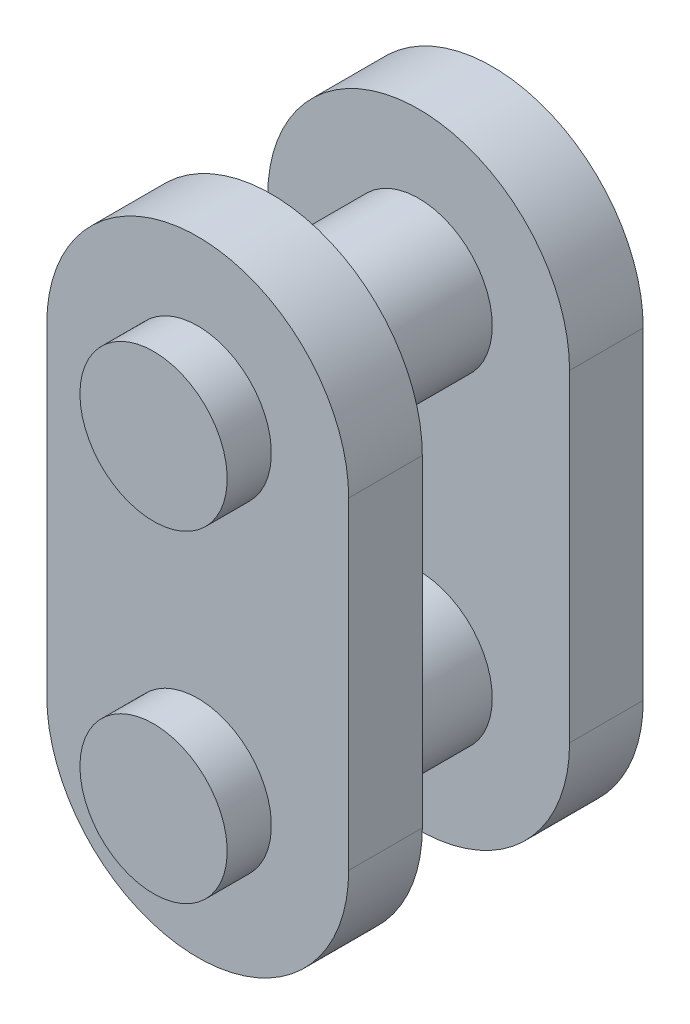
ISO-10303-21;
HEADER;
FILE_DESCRIPTION(('STEP AP214'),'2;1');
FILE_NAME('part.step','',(''),(''),'','','');
FILE_SCHEMA(('AUTOMOTIVE_DESIGN { 1 0 10303 214 1 1 1 1 }'));
ENDSEC;
DATA;
#1=APPLICATION_CONTEXT('core data for automotive mechanical design processes');
#2=APPLICATION_PROTOCOL_DEFINITION('international standard','automotive_design',2000,#1);
#3=PRODUCT_CONTEXT('',#1,'mechanical');
#4=PRODUCT('Part','Part','',(#3));
#5=PRODUCT_RELATED_PRODUCT_CATEGORY('part','',(#4));
#6=PRODUCT_DEFINITION_FORMATION('','',#4);
#7=PRODUCT_DEFINITION_CONTEXT('part definition',#1,'design');
#8=PRODUCT_DEFINITION('design','',#6,#7);
#9=PRODUCT_DEFINITION_SHAPE('','',#8);
#10=(LENGTH_UNIT() NAMED_UNIT(*) SI_UNIT(.MILLI.,.METRE.));
#11=(NAMED_UNIT(*) PLANE_ANGLE_UNIT() SI_UNIT($,.RADIAN.));
#12=(NAMED_UNIT(*) SI_UNIT($,.STERADIAN.) SOLID_ANGLE_UNIT());
#13=UNCERTAINTY_MEASURE_WITH_UNIT(LENGTH_MEASURE(1.E-05),#10,'distance_accuracy_value','');
#14=(GEOMETRIC_REPRESENTATION_CONTEXT(3) GLOBAL_UNCERTAINTY_ASSIGNED_CONTEXT((#13)) GLOBAL_UNIT_ASSIGNED_CONTEXT((#10,
#11,#12)) REPRESENTATION_CONTEXT('',''));
#15=CARTESIAN_POINT('',(0.,0.,0.));
#16=DIRECTION('',(0.,0.,1.));
#17=DIRECTION('',(1.,0.,0.));
#18=AXIS2_PLACEMENT_3D('',#15,#16,#17);
#19=CARTESIAN_POINT('',(0.,5.47500000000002,-5.));
#20=DIRECTION('',(0.,0.,-1.));
#21=DIRECTION('',(-1.00000000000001,0.,0.));
#22=AXIS2_PLACEMENT_3D('',#19,#20,#21);
#23=PLANE('',#22);
#24=CARTESIAN_POINT('',(1.31838984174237E-13,-5.47500000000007,-5.));
#25=DIRECTION('',(0.,0.,-1.));
#26=DIRECTION('',(-1.00000000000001,0.,0.));
#27=AXIS2_PLACEMENT_3D('',#24,#25,#26);
#28=CIRCLE('',#27,2.5);
#29=CARTESIAN_POINT('',(-2.49999999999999,-5.47499999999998,-4.99999999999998));
#30=VERTEX_POINT('',#29);
#31=EDGE_CURVE('E168',#30,#30,#28,.F.);
#32=ORIENTED_EDGE('',*,*,#31,.T.);
#33=EDGE_LOOP('',(#32));
#34=FACE_BOUND('',#33,.T.);
#35=CARTESIAN_POINT('',(0.,5.47500000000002,-5.));
#36=DIRECTION('',(0.,0.,1.));
#37=DIRECTION('',(-1.00000000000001,0.,0.));
#38=AXIS2_PLACEMENT_3D('',#35,#36,#37);
#39=CIRCLE('',#38,5.125);
#40=CARTESIAN_POINT('',(5.1250000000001,5.47500000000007,-5.));
#41=VERTEX_POINT('',#40);
#42=CARTESIAN_POINT('',(-5.125,5.47500000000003,-5.));
#43=VERTEX_POINT('',#42);
#44=EDGE_CURVE('E144',#41,#43,#39,.T.);
#45=ORIENTED_EDGE('',*,*,#44,.F.);
#46=DIRECTION('',(0.,1.00000000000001,0.));
#47=VECTOR('',#46,1.);
#48=CARTESIAN_POINT('',(5.1250000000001,5.47500000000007,-5.));
#49=LINE('',#48,#47);
#50=CARTESIAN_POINT('',(5.12500000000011,-5.47500000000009,-5.));
#51=VERTEX_POINT('',#50);
#52=EDGE_CURVE('E135',#51,#41,#49,.T.);
#53=ORIENTED_EDGE('',*,*,#52,.F.);
#54=CARTESIAN_POINT('',(1.31838984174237E-13,-5.47500000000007,-5.));
#55=DIRECTION('',(0.,0.,1.));
#56=DIRECTION('',(1.00000000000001,0.,0.));
#57=AXIS2_PLACEMENT_3D('',#54,#55,#56);
#58=CIRCLE('',#57,5.125);
#59=CARTESIAN_POINT('',(-5.12500000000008,-5.47499999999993,-5.));
#60=VERTEX_POINT('',#59);
#61=EDGE_CURVE('E138',#60,#51,#58,.T.);
#62=ORIENTED_EDGE('',*,*,#61,.F.);
#63=DIRECTION('',(0.,-1.00000000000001,0.));
#64=VECTOR('',#63,1.);
#65=CARTESIAN_POINT('',(-5.125,5.47500000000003,-5.));
#66=LINE('',#65,#64);
#67=EDGE_CURVE('E141',#43,#60,#66,.T.);
#68=ORIENTED_EDGE('',*,*,#67,.F.);
#69=EDGE_LOOP('',(#45,#53,#62,#68));
#70=FACE_BOUND('',#69,.T.);
#71=CARTESIAN_POINT('',(0.,5.47500000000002,-5.));
#72=DIRECTION('',(0.,0.,-1.));
#73=DIRECTION('',(-1.00000000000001,0.,0.));
#74=AXIS2_PLACEMENT_3D('',#71,#72,#73);
#75=CIRCLE('',#74,2.5);
#76=CARTESIAN_POINT('',(-2.50000000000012,5.4750000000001,-4.99999999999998));
#77=VERTEX_POINT('',#76);
#78=EDGE_CURVE('E177',#77,#77,#75,.F.);
#79=ORIENTED_EDGE('',*,*,#78,.T.);
#80=EDGE_LOOP('',(#79));
#81=FACE_BOUND('',#80,.T.);
#82=ADVANCED_FACE('F31',(#34,#70,#81),#23,.T.);
#83=CARTESIAN_POINT('',(1.45716771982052E-13,5.47500000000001,5.));
#84=DIRECTION('',(0.,0.,-1.));
#85=DIRECTION('',(-1.00000000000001,0.,0.));
#86=AXIS2_PLACEMENT_3D('',#83,#84,#85);
#87=PLANE('',#86);
#88=CARTESIAN_POINT('',(0.,-5.47500000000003,5.));
#89=DIRECTION('',(0.,0.,-1.));
#90=DIRECTION('',(-1.00000000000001,0.,0.));
#91=AXIS2_PLACEMENT_3D('',#88,#89,#90);
#92=CIRCLE('',#91,2.5);
#93=CARTESIAN_POINT('',(-2.49999999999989,-5.47500000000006,5.00000000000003));
#94=VERTEX_POINT('',#93);
#95=EDGE_CURVE('E35',#94,#94,#92,.F.);
#96=ORIENTED_EDGE('',*,*,#95,.F.);
#97=EDGE_LOOP('',(#96));
#98=FACE_BOUND('',#97,.T.);
#99=CARTESIAN_POINT('',(1.45716771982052E-13,5.47500000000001,5.));
#100=DIRECTION('',(0.,0.,1.));
#101=DIRECTION('',(-1.00000000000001,0.,0.));
#102=AXIS2_PLACEMENT_3D('',#99,#100,#101);
#103=CIRCLE('',#102,5.125);
#104=CARTESIAN_POINT('',(5.12500000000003,5.475,5.));
#105=VERTEX_POINT('',#104);
#106=CARTESIAN_POINT('',(-5.125,5.475,5.));
#107=VERTEX_POINT('',#106);
#108=EDGE_CURVE('E133',#105,#107,#103,.T.);
#109=ORIENTED_EDGE('',*,*,#108,.T.);
#110=DIRECTION('',(0.,-1.00000000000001,0.));
#111=VECTOR('',#110,1.);
#112=CARTESIAN_POINT('',(-5.125,5.475,5.));
#113=LINE('',#112,#111);
#114=CARTESIAN_POINT('',(-5.125,-5.47499999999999,5.));
#115=VERTEX_POINT('',#114);
#116=EDGE_CURVE('E114',#107,#115,#113,.T.);
#117=ORIENTED_EDGE('',*,*,#116,.T.);
#118=CARTESIAN_POINT('',(0.,-5.47500000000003,5.));
#119=DIRECTION('',(0.,0.,1.));
#120=DIRECTION('',(1.00000000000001,0.,0.));
#121=AXIS2_PLACEMENT_3D('',#118,#119,#120);
#122=CIRCLE('',#121,5.125);
#123=CARTESIAN_POINT('',(5.12500000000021,-5.47500000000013,5.));
#124=VERTEX_POINT('',#123);
#125=EDGE_CURVE('E130',#115,#124,#122,.T.);
#126=ORIENTED_EDGE('',*,*,#125,.T.);
#127=DIRECTION('',(0.,1.00000000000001,0.));
#128=VECTOR('',#127,1.);
#129=CARTESIAN_POINT('',(5.12500000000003,5.475,5.));
#130=LINE('',#129,#128);
#131=EDGE_CURVE('E128',#124,#105,#130,.T.);
#132=ORIENTED_EDGE('',*,*,#131,.T.);
#133=EDGE_LOOP('',(#109,#117,#126,#132));
#134=FACE_BOUND('',#133,.T.);
#135=CARTESIAN_POINT('',(1.45716771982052E-13,5.47500000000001,5.));
#136=DIRECTION('',(0.,0.,-1.));
#137=DIRECTION('',(-1.00000000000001,0.,0.));
#138=AXIS2_PLACEMENT_3D('',#135,#136,#137);
#139=CIRCLE('',#138,2.5);
#140=CARTESIAN_POINT('',(-2.50000000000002,5.47500000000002,5.00000000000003));
#141=VERTEX_POINT('',#140);
#142=EDGE_CURVE('E11',#141,#141,#139,.F.);
#143=ORIENTED_EDGE('',*,*,#142,.F.);
#144=EDGE_LOOP('',(#143));
#145=FACE_BOUND('',#144,.T.);
#146=ADVANCED_FACE('F200',(#98,#134,#145),#87,.F.);
#147=CARTESIAN_POINT('',(1.45716771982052E-13,5.47500000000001,5.));
#148=DIRECTION('',(0.,0.,-1.));
#149=DIRECTION('',(-1.00000000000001,0.,0.));
#150=AXIS2_PLACEMENT_3D('',#147,#148,#149);
#151=CYLINDRICAL_SURFACE('',#150,5.125);
#152=CARTESIAN_POINT('',(0.,5.47500000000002,-2.5));
#153=DIRECTION('',(0.,0.,1.));
#154=DIRECTION('',(1.00000000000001,0.,0.));
#155=AXIS2_PLACEMENT_3D('',#152,#153,#154);
#156=CIRCLE('',#155,5.125);
#157=CARTESIAN_POINT('',(5.1250000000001,5.47500000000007,-2.5));
#158=VERTEX_POINT('',#157);
#159=CARTESIAN_POINT('',(-5.125,5.47500000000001,-2.5));
#160=VERTEX_POINT('',#159);
#161=EDGE_CURVE('E152',#158,#160,#156,.T.);
#162=ORIENTED_EDGE('',*,*,#161,.F.);
#163=DIRECTION('',(0.,0.,-1.));
#164=VECTOR('',#163,1.);
#165=CARTESIAN_POINT('',(5.12500000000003,5.475,5.));
#166=LINE('',#165,#164);
#167=EDGE_CURVE('E127',#158,#41,#166,.T.);
#168=ORIENTED_EDGE('',*,*,#167,.T.);
#169=ORIENTED_EDGE('',*,*,#44,.T.);
#170=DIRECTION('',(0.,0.,-1.));
#171=VECTOR('',#170,1.);
#172=CARTESIAN_POINT('',(-5.125,5.475,5.));
#173=LINE('',#172,#171);
#174=EDGE_CURVE('E116',#160,#43,#173,.T.);
#175=ORIENTED_EDGE('',*,*,#174,.F.);
#176=EDGE_LOOP('',(#162,#168,#169,#175));
#177=FACE_BOUND('',#176,.T.);
#178=ADVANCED_FACE('F206',(#177),#151,.T.);
#179=CARTESIAN_POINT('',(-5.125,5.475,5.));
#180=DIRECTION('',(1.00000000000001,0.,0.));
#181=DIRECTION('',(0.,0.,-1.));
#182=AXIS2_PLACEMENT_3D('',#179,#180,#181);
#183=PLANE('',#182);
#184=DIRECTION('',(0.,-1.,0.));
#185=VECTOR('',#184,1.);
#186=CARTESIAN_POINT('',(-5.125,5.47500000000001,-2.5));
#187=LINE('',#186,#185);
#188=CARTESIAN_POINT('',(-5.12500000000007,-5.47499999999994,-2.5));
#189=VERTEX_POINT('',#188);
#190=EDGE_CURVE('E150',#160,#189,#187,.T.);
#191=ORIENTED_EDGE('',*,*,#190,.F.);
#192=ORIENTED_EDGE('',*,*,#174,.T.);
#193=ORIENTED_EDGE('',*,*,#67,.T.);
#194=DIRECTION('',(0.,0.,-1.));
#195=VECTOR('',#194,1.);
#196=CARTESIAN_POINT('',(-5.125,-5.47499999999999,5.));
#197=LINE('',#196,#195);
#198=EDGE_CURVE('E121',#189,#60,#197,.T.);
#199=ORIENTED_EDGE('',*,*,#198,.F.);
#200=EDGE_LOOP('',(#191,#192,#193,#199));
#201=FACE_BOUND('',#200,.T.);
#202=ADVANCED_FACE('F225',(#201),#183,.F.);
#203=CARTESIAN_POINT('',(0.,-5.47500000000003,5.));
#204=DIRECTION('',(0.,0.,-1.));
#205=DIRECTION('',(-1.00000000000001,0.,0.));
#206=AXIS2_PLACEMENT_3D('',#203,#204,#205);
#207=CYLINDRICAL_SURFACE('',#206,5.125);
#208=CARTESIAN_POINT('',(1.31838984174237E-13,-5.47500000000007,-2.5));
#209=DIRECTION('',(0.,0.,1.));
#210=DIRECTION('',(1.00000000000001,0.,0.));
#211=AXIS2_PLACEMENT_3D('',#208,#209,#210);
#212=CIRCLE('',#211,5.125);
#213=CARTESIAN_POINT('',(5.12500000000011,-5.47500000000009,-2.5));
#214=VERTEX_POINT('',#213);
#215=EDGE_CURVE('E47',#189,#214,#212,.T.);
#216=ORIENTED_EDGE('',*,*,#215,.F.);
#217=ORIENTED_EDGE('',*,*,#198,.T.);
#218=ORIENTED_EDGE('',*,*,#61,.T.);
#219=DIRECTION('',(0.,0.,-1.));
#220=VECTOR('',#219,1.);
#221=CARTESIAN_POINT('',(5.12500000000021,-5.47500000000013,5.));
#222=LINE('',#221,#220);
#223=EDGE_CURVE('E125',#214,#51,#222,.T.);
#224=ORIENTED_EDGE('',*,*,#223,.F.);
#225=EDGE_LOOP('',(#216,#217,#218,#224));
#226=FACE_BOUND('',#225,.T.);
#227=ADVANCED_FACE('F223',(#226),#207,.T.);
#228=CARTESIAN_POINT('',(5.12500000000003,5.475,5.));
#229=DIRECTION('',(-1.00000000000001,0.,0.));
#230=DIRECTION('',(0.,0.,1.));
#231=AXIS2_PLACEMENT_3D('',#228,#229,#230);
#232=PLANE('',#231);
#233=DIRECTION('',(0.,1.00000000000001,0.));
#234=VECTOR('',#233,1.);
#235=CARTESIAN_POINT('',(5.12500000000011,-5.47500000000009,-2.5));
#236=LINE('',#235,#234);
#237=EDGE_CURVE('E147',#214,#158,#236,.T.);
#238=ORIENTED_EDGE('',*,*,#237,.F.);
#239=ORIENTED_EDGE('',*,*,#223,.T.);
#240=ORIENTED_EDGE('',*,*,#52,.T.);
#241=ORIENTED_EDGE('',*,*,#167,.F.);
#242=EDGE_LOOP('',(#238,#239,#240,#241));
#243=FACE_BOUND('',#242,.T.);
#244=ADVANCED_FACE('F220',(#243),#232,.F.);
#245=CARTESIAN_POINT('',(0.,5.47500000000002,-2.5));
#246=DIRECTION('',(0.,0.,1.));
#247=DIRECTION('',(1.00000000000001,0.,0.));
#248=AXIS2_PLACEMENT_3D('',#245,#246,#247);
#249=PLANE('',#248);
#250=CARTESIAN_POINT('',(1.31838984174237E-13,-5.47500000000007,-2.5));
#251=DIRECTION('',(0.,0.,1.));
#252=DIRECTION('',(1.00000000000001,0.,0.));
#253=AXIS2_PLACEMENT_3D('',#250,#251,#252);
#254=CIRCLE('',#253,2.5);
#255=CARTESIAN_POINT('',(2.50000000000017,-5.47500000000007,-2.49999999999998));
#256=VERTEX_POINT('',#255);
#257=EDGE_CURVE('E162',#256,#256,#254,.T.);
#258=ORIENTED_EDGE('',*,*,#257,.F.);
#259=EDGE_LOOP('',(#258));
#260=FACE_BOUND('',#259,.T.);
#261=CARTESIAN_POINT('',(0.,5.47500000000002,-2.5));
#262=DIRECTION('',(0.,0.,1.));
#263=DIRECTION('',(1.00000000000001,0.,0.));
#264=AXIS2_PLACEMENT_3D('',#261,#262,#263);
#265=CIRCLE('',#264,2.5);
#266=CARTESIAN_POINT('',(2.50000000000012,5.47500000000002,-2.49999999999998));
#267=VERTEX_POINT('',#266);
#268=EDGE_CURVE('E111',#267,#267,#265,.T.);
#269=ORIENTED_EDGE('',*,*,#268,.F.);
#270=EDGE_LOOP('',(#269));
#271=FACE_BOUND('',#270,.T.);
#272=ORIENTED_EDGE('',*,*,#161,.T.);
#273=ORIENTED_EDGE('',*,*,#190,.T.);
#274=ORIENTED_EDGE('',*,*,#215,.T.);
#275=ORIENTED_EDGE('',*,*,#237,.T.);
#276=EDGE_LOOP('',(#272,#273,#274,#275));
#277=FACE_BOUND('',#276,.T.);
#278=ADVANCED_FACE('F211',(#260,#271,#277),#249,.T.);
#279=CARTESIAN_POINT('',(1.45716771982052E-13,5.47500000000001,2.5));
#280=DIRECTION('',(0.,0.,1.));
#281=DIRECTION('',(1.00000000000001,0.,0.));
#282=AXIS2_PLACEMENT_3D('',#279,#280,#281);
#283=PLANE('',#282);
#284=CARTESIAN_POINT('',(1.87350135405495E-13,-5.47500000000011,2.5));
#285=DIRECTION('',(0.,0.,1.));
#286=DIRECTION('',(1.00000000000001,0.,0.));
#287=AXIS2_PLACEMENT_3D('',#284,#285,#286);
#288=CIRCLE('',#287,2.5);
#289=CARTESIAN_POINT('',(2.50000000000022,-5.47500000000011,2.50000000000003));
#290=VERTEX_POINT('',#289);
#291=EDGE_CURVE('E165',#290,#290,#288,.T.);
#292=ORIENTED_EDGE('',*,*,#291,.T.);
#293=EDGE_LOOP('',(#292));
#294=FACE_BOUND('',#293,.T.);
#295=CARTESIAN_POINT('',(1.45716771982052E-13,5.47500000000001,2.5));
#296=DIRECTION('',(0.,0.,1.));
#297=DIRECTION('',(1.00000000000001,0.,0.));
#298=AXIS2_PLACEMENT_3D('',#295,#296,#297);
#299=CIRCLE('',#298,2.5);
#300=CARTESIAN_POINT('',(2.50000000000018,5.47500000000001,2.50000000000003));
#301=VERTEX_POINT('',#300);
#302=EDGE_CURVE('E159',#301,#301,#299,.T.);
#303=ORIENTED_EDGE('',*,*,#302,.T.);
#304=EDGE_LOOP('',(#303));
#305=FACE_BOUND('',#304,.T.);
#306=CARTESIAN_POINT('',(1.45716771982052E-13,5.47500000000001,2.5));
#307=DIRECTION('',(0.,0.,1.));
#308=DIRECTION('',(1.00000000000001,0.,0.));
#309=AXIS2_PLACEMENT_3D('',#306,#307,#308);
#310=CIRCLE('',#309,5.125);
#311=CARTESIAN_POINT('',(5.12500000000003,5.475,2.5));
#312=VERTEX_POINT('',#311);
#313=CARTESIAN_POINT('',(-5.125,5.47500000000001,2.5));
#314=VERTEX_POINT('',#313);
#315=EDGE_CURVE('E55',#312,#314,#310,.T.);
#316=ORIENTED_EDGE('',*,*,#315,.F.);
#317=DIRECTION('',(0.,1.00000000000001,0.));
#318=VECTOR('',#317,1.);
#319=CARTESIAN_POINT('',(5.12500000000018,-5.47500000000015,2.5));
#320=LINE('',#319,#318);
#321=CARTESIAN_POINT('',(5.12500000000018,-5.47500000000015,2.5));
#322=VERTEX_POINT('',#321);
#323=EDGE_CURVE('E154',#322,#312,#320,.T.);
#324=ORIENTED_EDGE('',*,*,#323,.F.);
#325=CARTESIAN_POINT('',(1.87350135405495E-13,-5.47500000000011,2.5));
#326=DIRECTION('',(0.,0.,1.));
#327=DIRECTION('',(1.00000000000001,0.,0.));
#328=AXIS2_PLACEMENT_3D('',#325,#326,#327);
#329=CIRCLE('',#328,5.125);
#330=CARTESIAN_POINT('',(-5.125,-5.47499999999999,2.5));
#331=VERTEX_POINT('',#330);
#332=EDGE_CURVE('E98',#331,#322,#329,.T.);
#333=ORIENTED_EDGE('',*,*,#332,.F.);
#334=DIRECTION('',(0.,-1.,0.));
#335=VECTOR('',#334,1.);
#336=CARTESIAN_POINT('',(-5.125,5.47500000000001,2.5));
#337=LINE('',#336,#335);
#338=EDGE_CURVE('E95',#314,#331,#337,.T.);
#339=ORIENTED_EDGE('',*,*,#338,.F.);
#340=EDGE_LOOP('',(#316,#324,#333,#339));
#341=FACE_BOUND('',#340,.T.);
#342=ADVANCED_FACE('F96',(#294,#305,#341),#283,.F.);
#343=CARTESIAN_POINT('',(0.,5.47500000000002,-2.5));
#344=DIRECTION('',(0.,0.,1.));
#345=DIRECTION('',(1.00000000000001,0.,0.));
#346=AXIS2_PLACEMENT_3D('',#343,#344,#345);
#347=CYLINDRICAL_SURFACE('',#346,2.5);
#348=ORIENTED_EDGE('',*,*,#268,.T.);
#349=EDGE_LOOP('',(#348));
#350=FACE_BOUND('',#349,.T.);
#351=ORIENTED_EDGE('',*,*,#302,.F.);
#352=EDGE_LOOP('',(#351));
#353=FACE_BOUND('',#352,.T.);
#354=ADVANCED_FACE('F256',(#350,#353),#347,.T.);
#355=CARTESIAN_POINT('',(1.31838984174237E-13,-5.47500000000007,-2.5));
#356=DIRECTION('',(0.,0.,1.));
#357=DIRECTION('',(1.00000000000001,0.,0.));
#358=AXIS2_PLACEMENT_3D('',#355,#356,#357);
#359=CYLINDRICAL_SURFACE('',#358,2.5);
#360=ORIENTED_EDGE('',*,*,#257,.T.);
#361=EDGE_LOOP('',(#360));
#362=FACE_BOUND('',#361,.T.);
#363=ORIENTED_EDGE('',*,*,#291,.F.);
#364=EDGE_LOOP('',(#363));
#365=FACE_BOUND('',#364,.T.);
#366=ADVANCED_FACE('F218',(#362,#365),#359,.T.);
#367=EDGE_CURVE('E122',#124,#322,#222,.T.);
#368=ORIENTED_EDGE('',*,*,#367,.T.);
#369=ORIENTED_EDGE('',*,*,#323,.T.);
#370=EDGE_CURVE('E110',#105,#312,#166,.T.);
#371=ORIENTED_EDGE('',*,*,#370,.F.);
#372=ORIENTED_EDGE('',*,*,#131,.F.);
#373=EDGE_LOOP('',(#368,#369,#371,#372));
#374=FACE_BOUND('',#373,.T.);
#375=ADVANCED_FACE('F214',(#374),#232,.F.);
#376=EDGE_CURVE('E118',#115,#331,#197,.T.);
#377=ORIENTED_EDGE('',*,*,#376,.T.);
#378=ORIENTED_EDGE('',*,*,#332,.T.);
#379=ORIENTED_EDGE('',*,*,#367,.F.);
#380=ORIENTED_EDGE('',*,*,#125,.F.);
#381=EDGE_LOOP('',(#377,#378,#379,#380));
#382=FACE_BOUND('',#381,.T.);
#383=ADVANCED_FACE('F217',(#382),#207,.T.);
#384=EDGE_CURVE('E108',#107,#314,#173,.T.);
#385=ORIENTED_EDGE('',*,*,#384,.T.);
#386=ORIENTED_EDGE('',*,*,#338,.T.);
#387=ORIENTED_EDGE('',*,*,#376,.F.);
#388=ORIENTED_EDGE('',*,*,#116,.F.);
#389=EDGE_LOOP('',(#385,#386,#387,#388));
#390=FACE_BOUND('',#389,.T.);
#391=ADVANCED_FACE('F113',(#390),#183,.F.);
#392=ORIENTED_EDGE('',*,*,#370,.T.);
#393=ORIENTED_EDGE('',*,*,#315,.T.);
#394=ORIENTED_EDGE('',*,*,#384,.F.);
#395=ORIENTED_EDGE('',*,*,#108,.F.);
#396=EDGE_LOOP('',(#392,#393,#394,#395));
#397=FACE_BOUND('',#396,.T.);
#398=ADVANCED_FACE('F33',(#397),#151,.T.);
#399=CARTESIAN_POINT('',(1.59594559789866E-13,-5.47500000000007,6.50000000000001));
#400=DIRECTION('',(0.,0.,1.));
#401=DIRECTION('',(1.00000000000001,0.,0.));
#402=AXIS2_PLACEMENT_3D('',#399,#400,#401);
#403=PLANE('',#402);
#404=CARTESIAN_POINT('',(1.59594559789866E-13,-5.47500000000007,6.50000000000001));
#405=DIRECTION('',(0.,0.,1.));
#406=DIRECTION('',(1.00000000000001,0.,0.));
#407=AXIS2_PLACEMENT_3D('',#404,#405,#406);
#408=CIRCLE('',#407,2.5);
#409=CARTESIAN_POINT('',(-2.49999999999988,-5.47500000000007,6.50000000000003));
#410=VERTEX_POINT('',#409);
#411=EDGE_CURVE('E171',#410,#410,#408,.T.);
#412=ORIENTED_EDGE('',*,*,#411,.T.);
#413=EDGE_LOOP('',(#412));
#414=FACE_BOUND('',#413,.T.);
#415=ADVANCED_FACE('F229',(#414),#403,.T.);
#416=CARTESIAN_POINT('',(1.59594559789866E-13,-5.47500000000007,6.50000000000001));
#417=DIRECTION('',(0.,0.,-1.));
#418=DIRECTION('',(-1.00000000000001,0.,0.));
#419=AXIS2_PLACEMENT_3D('',#416,#417,#418);
#420=CYLINDRICAL_SURFACE('',#419,2.5);
#421=CARTESIAN_POINT('',(-2.49999999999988,-5.47500000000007,6.50000000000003));
#422=CARTESIAN_POINT('',(-2.49999999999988,-5.47500000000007,6.48437500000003));
#423=CARTESIAN_POINT('',(-2.49999999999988,-5.47500000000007,6.46875000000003));
#424=CARTESIAN_POINT('',(-2.49999999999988,-5.47500000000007,6.43750000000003));
#425=CARTESIAN_POINT('',(-2.49999999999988,-5.47500000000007,6.42187500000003));
#426=CARTESIAN_POINT('',(-2.49999999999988,-5.47500000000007,6.39062500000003));
#427=CARTESIAN_POINT('',(-2.49999999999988,-5.47500000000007,6.37500000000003));
#428=CARTESIAN_POINT('',(-2.49999999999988,-5.47500000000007,6.34375000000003));
#429=CARTESIAN_POINT('',(-2.49999999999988,-5.47500000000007,6.32812500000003));
#430=CARTESIAN_POINT('',(-2.49999999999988,-5.47500000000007,6.29687500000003));
#431=CARTESIAN_POINT('',(-2.49999999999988,-5.47500000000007,6.28125000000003));
#432=CARTESIAN_POINT('',(-2.49999999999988,-5.47500000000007,6.25000000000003));
#433=CARTESIAN_POINT('',(-2.49999999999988,-5.47500000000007,6.23437500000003));
#434=CARTESIAN_POINT('',(-2.49999999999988,-5.47500000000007,6.20312500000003));
#435=CARTESIAN_POINT('',(-2.49999999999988,-5.47500000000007,6.18750000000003));
#436=CARTESIAN_POINT('',(-2.49999999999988,-5.47500000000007,6.15625000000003));
#437=CARTESIAN_POINT('',(-2.49999999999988,-5.47500000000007,6.14062500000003));
#438=CARTESIAN_POINT('',(-2.49999999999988,-5.47500000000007,6.10937500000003));
#439=CARTESIAN_POINT('',(-2.49999999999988,-5.47500000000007,6.09375000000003));
#440=CARTESIAN_POINT('',(-2.49999999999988,-5.47500000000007,6.06250000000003));
#441=CARTESIAN_POINT('',(-2.49999999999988,-5.47500000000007,6.04687500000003));
#442=CARTESIAN_POINT('',(-2.49999999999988,-5.47500000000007,6.01562500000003));
#443=CARTESIAN_POINT('',(-2.49999999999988,-5.47500000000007,6.00000000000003));
#444=CARTESIAN_POINT('',(-2.49999999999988,-5.47500000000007,5.96875000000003));
#445=CARTESIAN_POINT('',(-2.49999999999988,-5.47500000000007,5.95312500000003));
#446=CARTESIAN_POINT('',(-2.49999999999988,-5.47500000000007,5.92187500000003));
#447=CARTESIAN_POINT('',(-2.49999999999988,-5.47500000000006,5.90625000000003));
#448=CARTESIAN_POINT('',(-2.49999999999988,-5.47500000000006,5.87500000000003));
#449=CARTESIAN_POINT('',(-2.49999999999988,-5.47500000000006,5.85937500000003));
#450=CARTESIAN_POINT('',(-2.49999999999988,-5.47500000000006,5.82812500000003));
#451=CARTESIAN_POINT('',(-2.49999999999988,-5.47500000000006,5.81250000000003));
#452=CARTESIAN_POINT('',(-2.49999999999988,-5.47500000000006,5.78125000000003));
#453=CARTESIAN_POINT('',(-2.49999999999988,-5.47500000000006,5.76562500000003));
#454=CARTESIAN_POINT('',(-2.49999999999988,-5.47500000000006,5.73437500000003));
#455=CARTESIAN_POINT('',(-2.49999999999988,-5.47500000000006,5.71875000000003));
#456=CARTESIAN_POINT('',(-2.49999999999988,-5.47500000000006,5.68750000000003));
#457=CARTESIAN_POINT('',(-2.49999999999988,-5.47500000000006,5.67187500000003));
#458=CARTESIAN_POINT('',(-2.49999999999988,-5.47500000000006,5.64062500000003));
#459=CARTESIAN_POINT('',(-2.49999999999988,-5.47500000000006,5.62500000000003));
#460=CARTESIAN_POINT('',(-2.49999999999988,-5.47500000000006,5.59375000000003));
#461=CARTESIAN_POINT('',(-2.49999999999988,-5.47500000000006,5.57812500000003));
#462=CARTESIAN_POINT('',(-2.49999999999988,-5.47500000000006,5.54687500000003));
#463=CARTESIAN_POINT('',(-2.49999999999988,-5.47500000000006,5.53125000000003));
#464=CARTESIAN_POINT('',(-2.49999999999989,-5.47500000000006,5.50000000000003));
#465=CARTESIAN_POINT('',(-2.49999999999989,-5.47500000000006,5.48437500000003));
#466=CARTESIAN_POINT('',(-2.49999999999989,-5.47500000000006,5.45312500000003));
#467=CARTESIAN_POINT('',(-2.49999999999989,-5.47500000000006,5.43750000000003));
#468=CARTESIAN_POINT('',(-2.49999999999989,-5.47500000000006,5.40625000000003));
#469=CARTESIAN_POINT('',(-2.49999999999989,-5.47500000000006,5.39062500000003));
#470=CARTESIAN_POINT('',(-2.49999999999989,-5.47500000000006,5.35937500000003));
#471=CARTESIAN_POINT('',(-2.49999999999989,-5.47500000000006,5.34375000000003));
#472=CARTESIAN_POINT('',(-2.49999999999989,-5.47500000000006,5.31250000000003));
#473=CARTESIAN_POINT('',(-2.49999999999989,-5.47500000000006,5.29687500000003));
#474=CARTESIAN_POINT('',(-2.49999999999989,-5.47500000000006,5.26562500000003));
#475=CARTESIAN_POINT('',(-2.49999999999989,-5.47500000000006,5.25000000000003));
#476=CARTESIAN_POINT('',(-2.49999999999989,-5.47500000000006,5.21875000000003));
#477=CARTESIAN_POINT('',(-2.49999999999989,-5.47500000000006,5.20312500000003));
#478=CARTESIAN_POINT('',(-2.49999999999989,-5.47500000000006,5.17187500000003));
#479=CARTESIAN_POINT('',(-2.49999999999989,-5.47500000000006,5.15625000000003));
#480=CARTESIAN_POINT('',(-2.49999999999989,-5.47500000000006,5.12500000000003));
#481=CARTESIAN_POINT('',(-2.49999999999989,-5.47500000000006,5.10937500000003));
#482=CARTESIAN_POINT('',(-2.49999999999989,-5.47500000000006,5.07812500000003));
#483=CARTESIAN_POINT('',(-2.49999999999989,-5.47500000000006,5.06250000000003));
#484=CARTESIAN_POINT('',(-2.49999999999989,-5.47500000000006,5.03125000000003));
#485=CARTESIAN_POINT('',(-2.49999999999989,-5.47500000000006,5.01562500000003));
#486=CARTESIAN_POINT('',(-2.49999999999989,-5.47500000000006,5.00000000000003));
#487=B_SPLINE_CURVE_WITH_KNOTS('',3,(#421,#422,#423,#424,#425,#426,#427,#428,#429,#430,#431,
#432,#433,#434,#435,#436,#437,#438,#439,#440,#441,#442,#443,#444,#445,#446,#447,#448,#449,#450,
#451,#452,#453,#454,#455,#456,#457,#458,#459,#460,#461,#462,#463,#464,#465,#466,#467,#468,#469,
#470,#471,#472,#473,#474,#475,#476,#477,#478,#479,#480,#481,#482,#483,#484,#485,#486),
.UNSPECIFIED.,.F.,.F.,(4,2,2,2,2,2,2,2,2,2,2,2,2,2,2,2,2,2,2,2,2,2,2,2,2,2,2,2,2,2,2,2,4),(0.,
0.0468749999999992,0.0937499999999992,0.140624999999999,0.187499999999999,0.234374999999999,
0.281249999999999,0.328124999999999,0.374999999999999,0.421875,0.46875,0.515625,0.5625,0.609375,
0.65625,0.703125,0.75,0.796875,0.84375,0.890625,0.9375,0.984375,1.03125,1.078125,1.125,1.171875,
1.21875,1.265625,1.3125,1.359375,1.40625,1.453125,1.5),.UNSPECIFIED.);
#488=EDGE_CURVE('BSEAM277',#410,#94,#487,.T.);
#489=ORIENTED_EDGE('',*,*,#411,.F.);
#490=ORIENTED_EDGE('',*,*,#95,.T.);
#491=ORIENTED_EDGE('',*,*,#488,.T.);
#492=ORIENTED_EDGE('',*,*,#488,.F.);
#493=EDGE_LOOP('',(#489,#491,#490,#492));
#494=FACE_BOUND('',#493,.T.);
#495=ADVANCED_FACE('F277',(#494),#420,.T.);
#496=CARTESIAN_POINT('',(0.,-5.47499999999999,-6.50000000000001));
#497=DIRECTION('',(0.,0.,1.));
#498=DIRECTION('',(1.00000000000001,0.,0.));
#499=AXIS2_PLACEMENT_3D('',#496,#497,#498);
#500=CIRCLE('',#499,2.5);
#501=CARTESIAN_POINT('',(-2.5,-5.47499999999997,-6.49999999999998));
#502=VERTEX_POINT('',#501);
#503=EDGE_CURVE('E174',#502,#502,#500,.T.);
#504=CARTESIAN_POINT('',(-2.49999999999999,-5.47499999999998,-4.99999999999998));
#505=CARTESIAN_POINT('',(-2.49999999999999,-5.47499999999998,-5.01562499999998));
#506=CARTESIAN_POINT('',(-2.49999999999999,-5.47499999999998,-5.03124999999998));
#507=CARTESIAN_POINT('',(-2.49999999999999,-5.47499999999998,-5.06249999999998));
#508=CARTESIAN_POINT('',(-2.49999999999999,-5.47499999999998,-5.07812499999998));
#509=CARTESIAN_POINT('',(-2.49999999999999,-5.47499999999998,-5.10937499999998));
#510=CARTESIAN_POINT('',(-2.49999999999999,-5.47499999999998,-5.12499999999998));
#511=CARTESIAN_POINT('',(-2.49999999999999,-5.47499999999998,-5.15624999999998));
#512=CARTESIAN_POINT('',(-2.49999999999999,-5.47499999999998,-5.17187499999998));
#513=CARTESIAN_POINT('',(-2.49999999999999,-5.47499999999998,-5.20312499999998));
#514=CARTESIAN_POINT('',(-2.49999999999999,-5.47499999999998,-5.21874999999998));
#515=CARTESIAN_POINT('',(-2.49999999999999,-5.47499999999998,-5.24999999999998));
#516=CARTESIAN_POINT('',(-2.49999999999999,-5.47499999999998,-5.26562499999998));
#517=CARTESIAN_POINT('',(-2.49999999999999,-5.47499999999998,-5.29687499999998));
#518=CARTESIAN_POINT('',(-2.49999999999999,-5.47499999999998,-5.31249999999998));
#519=CARTESIAN_POINT('',(-2.49999999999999,-5.47499999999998,-5.34374999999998));
#520=CARTESIAN_POINT('',(-2.49999999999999,-5.47499999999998,-5.35937499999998));
#521=CARTESIAN_POINT('',(-2.49999999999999,-5.47499999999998,-5.39062499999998));
#522=CARTESIAN_POINT('',(-2.49999999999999,-5.47499999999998,-5.40624999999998));
#523=CARTESIAN_POINT('',(-2.49999999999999,-5.47499999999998,-5.43749999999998));
#524=CARTESIAN_POINT('',(-2.49999999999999,-5.47499999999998,-5.45312499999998));
#525=CARTESIAN_POINT('',(-2.49999999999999,-5.47499999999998,-5.48437499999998));
#526=CARTESIAN_POINT('',(-2.49999999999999,-5.47499999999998,-5.49999999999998));
#527=CARTESIAN_POINT('',(-2.5,-5.47499999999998,-5.53124999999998));
#528=CARTESIAN_POINT('',(-2.5,-5.47499999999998,-5.54687499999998));
#529=CARTESIAN_POINT('',(-2.5,-5.47499999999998,-5.57812499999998));
#530=CARTESIAN_POINT('',(-2.5,-5.47499999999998,-5.59374999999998));
#531=CARTESIAN_POINT('',(-2.5,-5.47499999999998,-5.62499999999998));
#532=CARTESIAN_POINT('',(-2.5,-5.47499999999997,-5.64062499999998));
#533=CARTESIAN_POINT('',(-2.5,-5.47499999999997,-5.67187499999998));
#534=CARTESIAN_POINT('',(-2.5,-5.47499999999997,-5.68749999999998));
#535=CARTESIAN_POINT('',(-2.5,-5.47499999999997,-5.71874999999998));
#536=CARTESIAN_POINT('',(-2.5,-5.47499999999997,-5.73437499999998));
#537=CARTESIAN_POINT('',(-2.5,-5.47499999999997,-5.76562499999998));
#538=CARTESIAN_POINT('',(-2.5,-5.47499999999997,-5.78124999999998));
#539=CARTESIAN_POINT('',(-2.5,-5.47499999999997,-5.81249999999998));
#540=CARTESIAN_POINT('',(-2.5,-5.47499999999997,-5.82812499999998));
#541=CARTESIAN_POINT('',(-2.5,-5.47499999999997,-5.85937499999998));
#542=CARTESIAN_POINT('',(-2.5,-5.47499999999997,-5.87499999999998));
#543=CARTESIAN_POINT('',(-2.5,-5.47499999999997,-5.90624999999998));
#544=CARTESIAN_POINT('',(-2.5,-5.47499999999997,-5.92187499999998));
#545=CARTESIAN_POINT('',(-2.5,-5.47499999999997,-5.95312499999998));
#546=CARTESIAN_POINT('',(-2.5,-5.47499999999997,-5.96874999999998));
#547=CARTESIAN_POINT('',(-2.5,-5.47499999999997,-5.99999999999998));
#548=CARTESIAN_POINT('',(-2.5,-5.47499999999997,-6.01562499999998));
#549=CARTESIAN_POINT('',(-2.5,-5.47499999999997,-6.04687499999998));
#550=CARTESIAN_POINT('',(-2.5,-5.47499999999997,-6.06249999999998));
#551=CARTESIAN_POINT('',(-2.5,-5.47499999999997,-6.09374999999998));
#552=CARTESIAN_POINT('',(-2.5,-5.47499999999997,-6.10937499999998));
#553=CARTESIAN_POINT('',(-2.5,-5.47499999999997,-6.14062499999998));
#554=CARTESIAN_POINT('',(-2.5,-5.47499999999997,-6.15624999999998));
#555=CARTESIAN_POINT('',(-2.5,-5.47499999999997,-6.18749999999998));
#556=CARTESIAN_POINT('',(-2.5,-5.47499999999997,-6.20312499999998));
#557=CARTESIAN_POINT('',(-2.5,-5.47499999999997,-6.23437499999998));
#558=CARTESIAN_POINT('',(-2.5,-5.47499999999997,-6.24999999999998));
#559=CARTESIAN_POINT('',(-2.5,-5.47499999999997,-6.28124999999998));
#560=CARTESIAN_POINT('',(-2.5,-5.47499999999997,-6.29687499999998));
#561=CARTESIAN_POINT('',(-2.5,-5.47499999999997,-6.32812499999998));
#562=CARTESIAN_POINT('',(-2.5,-5.47499999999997,-6.34374999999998));
#563=CARTESIAN_POINT('',(-2.5,-5.47499999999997,-6.37499999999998));
#564=CARTESIAN_POINT('',(-2.5,-5.47499999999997,-6.39062499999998));
#565=CARTESIAN_POINT('',(-2.5,-5.47499999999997,-6.42187499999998));
#566=CARTESIAN_POINT('',(-2.5,-5.47499999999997,-6.43749999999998));
#567=CARTESIAN_POINT('',(-2.5,-5.47499999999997,-6.46874999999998));
#568=CARTESIAN_POINT('',(-2.5,-5.47499999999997,-6.48437499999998));
#569=CARTESIAN_POINT('',(-2.5,-5.47499999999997,-6.49999999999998));
#570=B_SPLINE_CURVE_WITH_KNOTS('',3,(#504,#505,#506,#507,#508,#509,#510,#511,#512,#513,#514,
#515,#516,#517,#518,#519,#520,#521,#522,#523,#524,#525,#526,#527,#528,#529,#530,#531,#532,#533,
#534,#535,#536,#537,#538,#539,#540,#541,#542,#543,#544,#545,#546,#547,#548,#549,#550,#551,#552,
#553,#554,#555,#556,#557,#558,#559,#560,#561,#562,#563,#564,#565,#566,#567,#568,#569),
.UNSPECIFIED.,.F.,.F.,(4,2,2,2,2,2,2,2,2,2,2,2,2,2,2,2,2,2,2,2,2,2,2,2,2,2,2,2,2,2,2,2,4),(0.,
0.046875,0.0937500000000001,0.140625,0.1875,0.234375,0.28125,0.328125,0.375,0.421875,0.46875,
0.515625,0.5625,0.609375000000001,0.656250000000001,0.703125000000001,0.750000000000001,
0.796875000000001,0.843750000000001,0.890625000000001,0.937500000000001,0.984375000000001,
1.03125,1.078125,1.125,1.171875,1.21875,1.265625,1.3125,1.359375,1.40625,1.453125,1.5),.UNSPECIFIED.);
#571=EDGE_CURVE('BSEAM273',#30,#502,#570,.T.);
#572=ORIENTED_EDGE('',*,*,#31,.F.);
#573=ORIENTED_EDGE('',*,*,#503,.T.);
#574=ORIENTED_EDGE('',*,*,#571,.T.);
#575=ORIENTED_EDGE('',*,*,#571,.F.);
#576=EDGE_LOOP('',(#572,#574,#573,#575));
#577=FACE_BOUND('',#576,.T.);
#578=ADVANCED_FACE('F273',(#577),#420,.T.);
#579=CARTESIAN_POINT('',(0.,-5.47499999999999,-6.50000000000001));
#580=DIRECTION('',(0.,0.,1.));
#581=DIRECTION('',(1.00000000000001,0.,0.));
#582=AXIS2_PLACEMENT_3D('',#579,#580,#581);
#583=PLANE('',#582);
#584=ORIENTED_EDGE('',*,*,#503,.F.);
#585=EDGE_LOOP('',(#584));
#586=FACE_BOUND('',#585,.T.);
#587=ADVANCED_FACE('F276',(#586),#583,.F.);
#588=CARTESIAN_POINT('',(0.,5.47500000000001,6.50000000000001));
#589=DIRECTION('',(0.,0.,1.));
#590=DIRECTION('',(1.00000000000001,0.,0.));
#591=AXIS2_PLACEMENT_3D('',#588,#589,#590);
#592=PLANE('',#591);
#593=CARTESIAN_POINT('',(0.,5.47500000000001,6.50000000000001));
#594=DIRECTION('',(0.,0.,1.));
#595=DIRECTION('',(1.00000000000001,0.,0.));
#596=AXIS2_PLACEMENT_3D('',#593,#594,#595);
#597=CIRCLE('',#596,2.5);
#598=CARTESIAN_POINT('',(-2.5,5.47500000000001,6.50000000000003));
#599=VERTEX_POINT('',#598);
#600=EDGE_CURVE('E179',#599,#599,#597,.T.);
#601=ORIENTED_EDGE('',*,*,#600,.T.);
#602=EDGE_LOOP('',(#601));
#603=FACE_BOUND('',#602,.T.);
#604=ADVANCED_FACE('F283',(#603),#592,.T.);
#605=CARTESIAN_POINT('',(0.,5.47500000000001,6.50000000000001));
#606=DIRECTION('',(0.,0.,-1.));
#607=DIRECTION('',(-1.00000000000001,0.,0.));
#608=AXIS2_PLACEMENT_3D('',#605,#606,#607);
#609=CYLINDRICAL_SURFACE('',#608,2.5);
#610=CARTESIAN_POINT('',(-2.5,5.47500000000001,6.50000000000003));
#611=CARTESIAN_POINT('',(-2.5,5.47500000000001,6.48437500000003));
#612=CARTESIAN_POINT('',(-2.5,5.47500000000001,6.46875000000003));
#613=CARTESIAN_POINT('',(-2.5,5.47500000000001,6.43750000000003));
#614=CARTESIAN_POINT('',(-2.5,5.47500000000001,6.42187500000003));
#615=CARTESIAN_POINT('',(-2.5,5.47500000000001,6.39062500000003));
#616=CARTESIAN_POINT('',(-2.5,5.47500000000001,6.37500000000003));
#617=CARTESIAN_POINT('',(-2.5,5.47500000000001,6.34375000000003));
#618=CARTESIAN_POINT('',(-2.5,5.47500000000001,6.32812500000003));
#619=CARTESIAN_POINT('',(-2.5,5.47500000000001,6.29687500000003));
#620=CARTESIAN_POINT('',(-2.5,5.47500000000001,6.28125000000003));
#621=CARTESIAN_POINT('',(-2.5,5.47500000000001,6.25000000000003));
#622=CARTESIAN_POINT('',(-2.5,5.47500000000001,6.23437500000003));
#623=CARTESIAN_POINT('',(-2.5,5.47500000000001,6.20312500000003));
#624=CARTESIAN_POINT('',(-2.5,5.47500000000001,6.18750000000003));
#625=CARTESIAN_POINT('',(-2.5,5.47500000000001,6.15625000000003));
#626=CARTESIAN_POINT('',(-2.5,5.47500000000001,6.14062500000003));
#627=CARTESIAN_POINT('',(-2.5,5.47500000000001,6.10937500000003));
#628=CARTESIAN_POINT('',(-2.5,5.47500000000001,6.09375000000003));
#629=CARTESIAN_POINT('',(-2.5,5.47500000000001,6.06250000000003));
#630=CARTESIAN_POINT('',(-2.50000000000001,5.47500000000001,6.04687500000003));
#631=CARTESIAN_POINT('',(-2.50000000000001,5.47500000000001,6.01562500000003));
#632=CARTESIAN_POINT('',(-2.50000000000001,5.47500000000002,6.00000000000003));
#633=CARTESIAN_POINT('',(-2.50000000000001,5.47500000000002,5.96875000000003));
#634=CARTESIAN_POINT('',(-2.50000000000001,5.47500000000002,5.95312500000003));
#635=CARTESIAN_POINT('',(-2.50000000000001,5.47500000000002,5.92187500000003));
#636=CARTESIAN_POINT('',(-2.50000000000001,5.47500000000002,5.90625000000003));
#637=CARTESIAN_POINT('',(-2.50000000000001,5.47500000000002,5.87500000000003));
#638=CARTESIAN_POINT('',(-2.50000000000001,5.47500000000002,5.85937500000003));
#639=CARTESIAN_POINT('',(-2.50000000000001,5.47500000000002,5.82812500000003));
#640=CARTESIAN_POINT('',(-2.50000000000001,5.47500000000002,5.81250000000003));
#641=CARTESIAN_POINT('',(-2.50000000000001,5.47500000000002,5.78125000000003));
#642=CARTESIAN_POINT('',(-2.50000000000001,5.47500000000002,5.76562500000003));
#643=CARTESIAN_POINT('',(-2.50000000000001,5.47500000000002,5.73437500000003));
#644=CARTESIAN_POINT('',(-2.50000000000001,5.47500000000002,5.71875000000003));
#645=CARTESIAN_POINT('',(-2.50000000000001,5.47500000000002,5.68750000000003));
#646=CARTESIAN_POINT('',(-2.50000000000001,5.47500000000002,5.67187500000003));
#647=CARTESIAN_POINT('',(-2.50000000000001,5.47500000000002,5.64062500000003));
#648=CARTESIAN_POINT('',(-2.50000000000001,5.47500000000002,5.62500000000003));
#649=CARTESIAN_POINT('',(-2.50000000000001,5.47500000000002,5.59375000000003));
#650=CARTESIAN_POINT('',(-2.50000000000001,5.47500000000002,5.57812500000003));
#651=CARTESIAN_POINT('',(-2.50000000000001,5.47500000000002,5.54687500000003));
#652=CARTESIAN_POINT('',(-2.50000000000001,5.47500000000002,5.53125000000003));
#653=CARTESIAN_POINT('',(-2.50000000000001,5.47500000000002,5.50000000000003));
#654=CARTESIAN_POINT('',(-2.50000000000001,5.47500000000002,5.48437500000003));
#655=CARTESIAN_POINT('',(-2.50000000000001,5.47500000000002,5.45312500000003));
#656=CARTESIAN_POINT('',(-2.50000000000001,5.47500000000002,5.43750000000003));
#657=CARTESIAN_POINT('',(-2.50000000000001,5.47500000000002,5.40625000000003));
#658=CARTESIAN_POINT('',(-2.50000000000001,5.47500000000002,5.39062500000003));
#659=CARTESIAN_POINT('',(-2.50000000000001,5.47500000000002,5.35937500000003));
#660=CARTESIAN_POINT('',(-2.50000000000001,5.47500000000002,5.34375000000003));
#661=CARTESIAN_POINT('',(-2.50000000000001,5.47500000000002,5.31250000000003));
#662=CARTESIAN_POINT('',(-2.50000000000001,5.47500000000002,5.29687500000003));
#663=CARTESIAN_POINT('',(-2.50000000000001,5.47500000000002,5.26562500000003));
#664=CARTESIAN_POINT('',(-2.50000000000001,5.47500000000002,5.25000000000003));
#665=CARTESIAN_POINT('',(-2.50000000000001,5.47500000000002,5.21875000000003));
#666=CARTESIAN_POINT('',(-2.50000000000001,5.47500000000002,5.20312500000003));
#667=CARTESIAN_POINT('',(-2.50000000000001,5.47500000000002,5.17187500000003));
#668=CARTESIAN_POINT('',(-2.50000000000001,5.47500000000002,5.15625000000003));
#669=CARTESIAN_POINT('',(-2.50000000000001,5.47500000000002,5.12500000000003));
#670=CARTESIAN_POINT('',(-2.50000000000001,5.47500000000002,5.10937500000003));
#671=CARTESIAN_POINT('',(-2.50000000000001,5.47500000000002,5.07812500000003));
#672=CARTESIAN_POINT('',(-2.50000000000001,5.47500000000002,5.06250000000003));
#673=CARTESIAN_POINT('',(-2.50000000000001,5.47500000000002,5.03125000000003));
#674=CARTESIAN_POINT('',(-2.50000000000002,5.47500000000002,5.01562500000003));
#675=CARTESIAN_POINT('',(-2.50000000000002,5.47500000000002,5.00000000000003));
#676=B_SPLINE_CURVE_WITH_KNOTS('',3,(#610,#611,#612,#613,#614,#615,#616,#617,#618,#619,#620,
#621,#622,#623,#624,#625,#626,#627,#628,#629,#630,#631,#632,#633,#634,#635,#636,#637,#638,#639,
#640,#641,#642,#643,#644,#645,#646,#647,#648,#649,#650,#651,#652,#653,#654,#655,#656,#657,#658,
#659,#660,#661,#662,#663,#664,#665,#666,#667,#668,#669,#670,#671,#672,#673,#674,#675),
.UNSPECIFIED.,.F.,.F.,(4,2,2,2,2,2,2,2,2,2,2,2,2,2,2,2,2,2,2,2,2,2,2,2,2,2,2,2,2,2,2,2,4),(0.,
0.0468749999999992,0.0937499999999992,0.140624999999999,0.187499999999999,0.234374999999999,
0.281249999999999,0.328124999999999,0.374999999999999,0.421875,0.46875,0.515625,0.5625,0.609375,
0.65625,0.703125,0.75,0.796875,0.84375,0.890625,0.9375,0.984375,1.03125,1.078125,1.125,1.171875,
1.21875,1.265625,1.3125,1.359375,1.40625,1.453125,1.5),.UNSPECIFIED.);
#677=EDGE_CURVE('BSEAM195',#599,#141,#676,.T.);
#678=ORIENTED_EDGE('',*,*,#600,.F.);
#679=ORIENTED_EDGE('',*,*,#142,.T.);
#680=ORIENTED_EDGE('',*,*,#677,.T.);
#681=ORIENTED_EDGE('',*,*,#677,.F.);
#682=EDGE_LOOP('',(#678,#680,#679,#681));
#683=FACE_BOUND('',#682,.T.);
#684=ADVANCED_FACE('F195',(#683),#609,.T.);
#685=CARTESIAN_POINT('',(0.,5.475,-6.50000000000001));
#686=DIRECTION('',(0.,0.,1.));
#687=DIRECTION('',(1.00000000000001,0.,0.));
#688=AXIS2_PLACEMENT_3D('',#685,#686,#687);
#689=CIRCLE('',#688,2.5);
#690=CARTESIAN_POINT('',(-2.50000000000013,5.47500000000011,-6.49999999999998));
#691=VERTEX_POINT('',#690);
#692=EDGE_CURVE('E183',#691,#691,#689,.T.);
#693=CARTESIAN_POINT('',(-2.50000000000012,5.4750000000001,-4.99999999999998));
#694=CARTESIAN_POINT('',(-2.50000000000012,5.4750000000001,-5.01562499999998));
#695=CARTESIAN_POINT('',(-2.50000000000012,5.4750000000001,-5.03124999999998));
#696=CARTESIAN_POINT('',(-2.50000000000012,5.4750000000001,-5.06249999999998));
#697=CARTESIAN_POINT('',(-2.50000000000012,5.4750000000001,-5.07812499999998));
#698=CARTESIAN_POINT('',(-2.50000000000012,5.4750000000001,-5.10937499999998));
#699=CARTESIAN_POINT('',(-2.50000000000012,5.4750000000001,-5.12499999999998));
#700=CARTESIAN_POINT('',(-2.50000000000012,5.4750000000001,-5.15624999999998));
#701=CARTESIAN_POINT('',(-2.50000000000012,5.4750000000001,-5.17187499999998));
#702=CARTESIAN_POINT('',(-2.50000000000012,5.4750000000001,-5.20312499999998));
#703=CARTESIAN_POINT('',(-2.50000000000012,5.4750000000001,-5.21874999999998));
#704=CARTESIAN_POINT('',(-2.50000000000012,5.4750000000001,-5.24999999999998));
#705=CARTESIAN_POINT('',(-2.50000000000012,5.4750000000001,-5.26562499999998));
#706=CARTESIAN_POINT('',(-2.50000000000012,5.4750000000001,-5.29687499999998));
#707=CARTESIAN_POINT('',(-2.50000000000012,5.4750000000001,-5.31249999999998));
#708=CARTESIAN_POINT('',(-2.50000000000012,5.4750000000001,-5.34374999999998));
#709=CARTESIAN_POINT('',(-2.50000000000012,5.4750000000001,-5.35937499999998));
#710=CARTESIAN_POINT('',(-2.50000000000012,5.4750000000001,-5.39062499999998));
#711=CARTESIAN_POINT('',(-2.50000000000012,5.4750000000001,-5.40624999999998));
#712=CARTESIAN_POINT('',(-2.50000000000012,5.4750000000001,-5.43749999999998));
#713=CARTESIAN_POINT('',(-2.50000000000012,5.4750000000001,-5.45312499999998));
#714=CARTESIAN_POINT('',(-2.50000000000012,5.4750000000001,-5.48437499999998));
#715=CARTESIAN_POINT('',(-2.50000000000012,5.4750000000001,-5.49999999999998));
#716=CARTESIAN_POINT('',(-2.50000000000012,5.4750000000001,-5.53124999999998));
#717=CARTESIAN_POINT('',(-2.50000000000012,5.47500000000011,-5.54687499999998));
#718=CARTESIAN_POINT('',(-2.50000000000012,5.47500000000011,-5.57812499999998));
#719=CARTESIAN_POINT('',(-2.50000000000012,5.47500000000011,-5.59374999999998));
#720=CARTESIAN_POINT('',(-2.50000000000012,5.47500000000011,-5.62499999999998));
#721=CARTESIAN_POINT('',(-2.50000000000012,5.47500000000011,-5.64062499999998));
#722=CARTESIAN_POINT('',(-2.50000000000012,5.47500000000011,-5.67187499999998));
#723=CARTESIAN_POINT('',(-2.50000000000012,5.47500000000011,-5.68749999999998));
#724=CARTESIAN_POINT('',(-2.50000000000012,5.47500000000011,-5.71874999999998));
#725=CARTESIAN_POINT('',(-2.50000000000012,5.47500000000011,-5.73437499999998));
#726=CARTESIAN_POINT('',(-2.50000000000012,5.47500000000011,-5.76562499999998));
#727=CARTESIAN_POINT('',(-2.50000000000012,5.47500000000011,-5.78124999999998));
#728=CARTESIAN_POINT('',(-2.50000000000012,5.47500000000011,-5.81249999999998));
#729=CARTESIAN_POINT('',(-2.50000000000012,5.47500000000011,-5.82812499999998));
#730=CARTESIAN_POINT('',(-2.50000000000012,5.47500000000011,-5.85937499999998));
#731=CARTESIAN_POINT('',(-2.50000000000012,5.47500000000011,-5.87499999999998));
#732=CARTESIAN_POINT('',(-2.50000000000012,5.47500000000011,-5.90624999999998));
#733=CARTESIAN_POINT('',(-2.50000000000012,5.47500000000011,-5.92187499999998));
#734=CARTESIAN_POINT('',(-2.50000000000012,5.47500000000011,-5.95312499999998));
#735=CARTESIAN_POINT('',(-2.50000000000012,5.47500000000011,-5.96874999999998));
#736=CARTESIAN_POINT('',(-2.50000000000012,5.47500000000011,-5.99999999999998));
#737=CARTESIAN_POINT('',(-2.50000000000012,5.47500000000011,-6.01562499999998));
#738=CARTESIAN_POINT('',(-2.50000000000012,5.47500000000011,-6.04687499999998));
#739=CARTESIAN_POINT('',(-2.50000000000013,5.47500000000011,-6.06249999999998));
#740=CARTESIAN_POINT('',(-2.50000000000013,5.47500000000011,-6.09374999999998));
#741=CARTESIAN_POINT('',(-2.50000000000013,5.47500000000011,-6.10937499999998));
#742=CARTESIAN_POINT('',(-2.50000000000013,5.47500000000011,-6.14062499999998));
#743=CARTESIAN_POINT('',(-2.50000000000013,5.47500000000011,-6.15624999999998));
#744=CARTESIAN_POINT('',(-2.50000000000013,5.47500000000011,-6.18749999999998));
#745=CARTESIAN_POINT('',(-2.50000000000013,5.47500000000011,-6.20312499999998));
#746=CARTESIAN_POINT('',(-2.50000000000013,5.47500000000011,-6.23437499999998));
#747=CARTESIAN_POINT('',(-2.50000000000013,5.47500000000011,-6.24999999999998));
#748=CARTESIAN_POINT('',(-2.50000000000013,5.47500000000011,-6.28124999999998));
#749=CARTESIAN_POINT('',(-2.50000000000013,5.47500000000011,-6.29687499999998));
#750=CARTESIAN_POINT('',(-2.50000000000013,5.47500000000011,-6.32812499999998));
#751=CARTESIAN_POINT('',(-2.50000000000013,5.47500000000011,-6.34374999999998));
#752=CARTESIAN_POINT('',(-2.50000000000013,5.47500000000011,-6.37499999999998));
#753=CARTESIAN_POINT('',(-2.50000000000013,5.47500000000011,-6.39062499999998));
#754=CARTESIAN_POINT('',(-2.50000000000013,5.47500000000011,-6.42187499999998));
#755=CARTESIAN_POINT('',(-2.50000000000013,5.47500000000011,-6.43749999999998));
#756=CARTESIAN_POINT('',(-2.50000000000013,5.47500000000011,-6.46874999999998));
#757=CARTESIAN_POINT('',(-2.50000000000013,5.47500000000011,-6.48437499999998));
#758=CARTESIAN_POINT('',(-2.50000000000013,5.47500000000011,-6.49999999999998));
#759=B_SPLINE_CURVE_WITH_KNOTS('',3,(#693,#694,#695,#696,#697,#698,#699,#700,#701,#702,#703,
#704,#705,#706,#707,#708,#709,#710,#711,#712,#713,#714,#715,#716,#717,#718,#719,#720,#721,#722,
#723,#724,#725,#726,#727,#728,#729,#730,#731,#732,#733,#734,#735,#736,#737,#738,#739,#740,#741,
#742,#743,#744,#745,#746,#747,#748,#749,#750,#751,#752,#753,#754,#755,#756,#757,#758),
.UNSPECIFIED.,.F.,.F.,(4,2,2,2,2,2,2,2,2,2,2,2,2,2,2,2,2,2,2,2,2,2,2,2,2,2,2,2,2,2,2,2,4),(0.,
0.046875,0.0937500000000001,0.140625,0.1875,0.234375,0.28125,0.328125,0.375,0.421875,0.46875,
0.515625,0.5625,0.609375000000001,0.656250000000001,0.703125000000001,0.750000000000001,
0.796875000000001,0.843750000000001,0.890625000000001,0.937500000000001,0.984375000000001,
1.03125,1.078125,1.125,1.171875,1.21875,1.265625,1.3125,1.359375,1.40625,1.453125,1.5),.UNSPECIFIED.);
#760=EDGE_CURVE('BSEAM187',#77,#691,#759,.T.);
#761=ORIENTED_EDGE('',*,*,#78,.F.);
#762=ORIENTED_EDGE('',*,*,#692,.T.);
#763=ORIENTED_EDGE('',*,*,#760,.T.);
#764=ORIENTED_EDGE('',*,*,#760,.F.);
#765=EDGE_LOOP('',(#761,#763,#762,#764));
#766=FACE_BOUND('',#765,.T.);
#767=ADVANCED_FACE('F187',(#766),#609,.T.);
#768=CARTESIAN_POINT('',(0.,5.475,-6.50000000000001));
#769=DIRECTION('',(0.,0.,1.));
#770=DIRECTION('',(1.00000000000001,0.,0.));
#771=AXIS2_PLACEMENT_3D('',#768,#769,#770);
#772=PLANE('',#771);
#773=ORIENTED_EDGE('',*,*,#692,.F.);
#774=EDGE_LOOP('',(#773));
#775=FACE_BOUND('',#774,.T.);
#776=ADVANCED_FACE('F189',(#775),#772,.F.);
#777=CLOSED_SHELL('',(#82,#146,#178,#202,#227,#244,#278,#342,#354,#366,#375,#383,#391,#398,#415,
#495,#578,#587,#604,#684,#767,#776));
#778=MANIFOLD_SOLID_BREP('B2',#777);
#779=ADVANCED_BREP_SHAPE_REPRESENTATION('',(#18,#778),#14);
#780=SHAPE_DEFINITION_REPRESENTATION(#9,#779);
ENDSEC;
END-ISO-10303-21;
